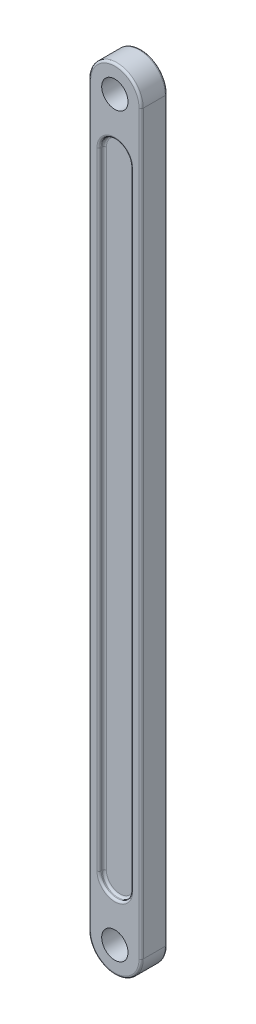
from build123d import *

# Parameters (mm, degrees)
SKETCH1_R      = 12.5
EXTRUDE1_DEPTH = 12.5
EXTRUDE2_START = 7.5
EXTRUDE2_DEPTH = 719.038593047
FILLET1_R      = 2
FILLET2_R      = 2


with BuildPart() as part:
    # Sketch1 → Extrude1 (new, symmetric)
    with BuildSketch(Plane.XY):
        with BuildLine():
            Line((25, 700), (25, 0))
            ThreePointArc((25, 0), (0, -25), (-25, 0))
            Line((-25, 0), (-25, 700))
            ThreePointArc((-25, 700), (0, 725), (25, 700))
        make_face()
        Circle(SKETCH1_R, mode=Mode.SUBTRACT)
        with Locations((0, 700)):
            Circle(SKETCH1_R, mode=Mode.SUBTRACT)
    extrude(amount=EXTRUDE1_DEPTH, both=True)

    # Sketch1_3 → Extrude2 (cut, through all)
    with BuildSketch(Plane.XY.offset(EXTRUDE2_START)):
        with BuildLine():
            Line((15, 647.5), (15, 52.5))
            ThreePointArc((15, 52.5), (0, 37.5), (-15, 52.5))
            Line((-15, 52.5), (-15, 647.5))
            ThreePointArc((-15, 647.5), (0, 662.5), (15, 647.5))
        make_face()
    extrude2 = extrude(amount=EXTRUDE2_DEPTH, mode=Mode.SUBTRACT)

    # Mirror1: Extrude2 across plane
    add(extrude2.mirror(Plane.XY), mode=Mode.SUBTRACT)

    # Fillet1
    fillet1_edges = [part.edges().sort_by_distance(p)[0] for p in [
        (0, 662.5, 7.5),
        (-15, 350, 7.5),
        (0, 37.5, 7.5),
        (15, 350, 12.5),
        (0, 662.5, 12.5),
        (-15, 350, 12.5),
        (0, 37.5, 12.5),
        (15, 350, 7.5),
        (0, 662.5, -12.5),
        (15, 350, -7.5),
        (0, 37.5, -12.5),
        (-15, 350, -12.5),
        (15, 350, -12.5),
        (0, 662.5, -7.5),
        (-15, 350, -7.5),
        (0, 37.5, -7.5),
    ]]
    fillet(fillet1_edges, radius=FILLET1_R)

    # Fillet2
    fillet2_edges = [part.edges().sort_by_distance(p)[0] for p in [
        (0, 725, -12.5),
        (25, 350, -12.5),
        (0, -25, -12.5),
        (-25, 350, -12.5),
        (-25, 350, 12.5),
        (0, -25, 12.5),
        (25, 350, 12.5),
        (0, 725, 12.5),
    ]]
    fillet(fillet2_edges, radius=FILLET2_R)


solid = part.part
